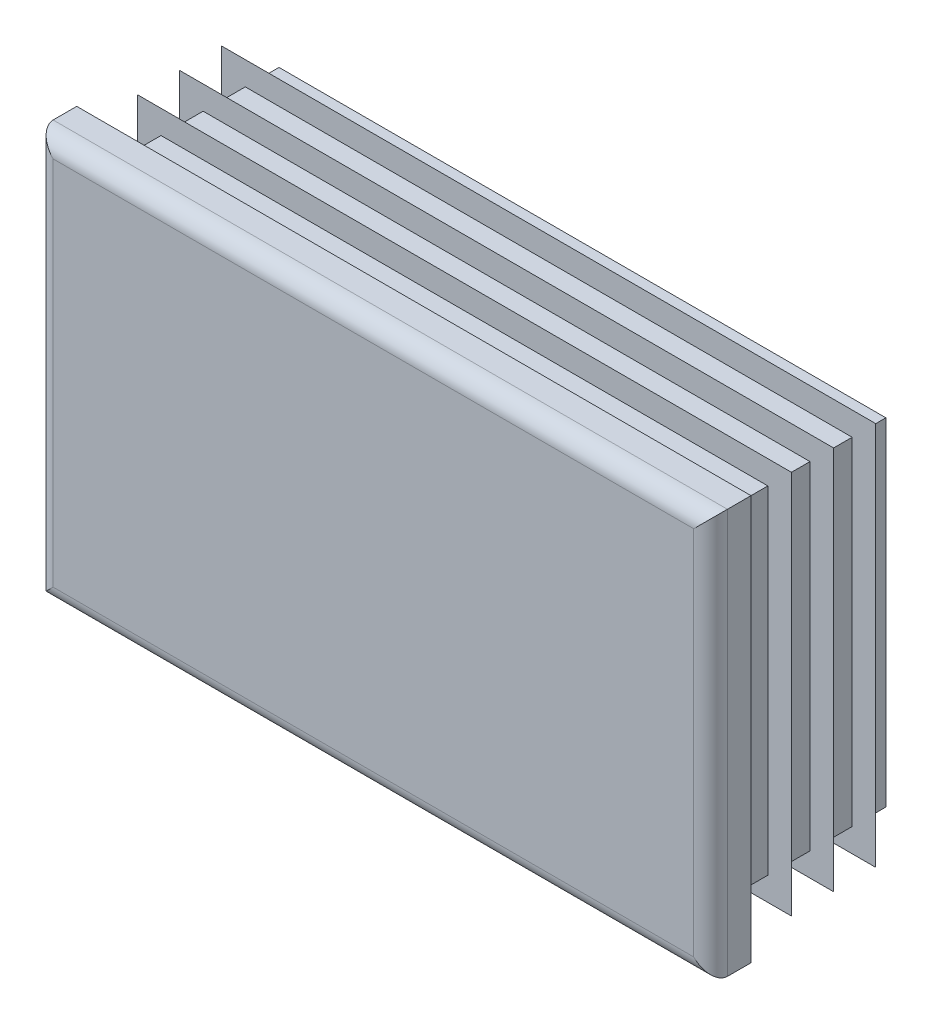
ISO-10303-21;
HEADER;
FILE_DESCRIPTION(('STEP AP214'),'2;1');
FILE_NAME('part.step','',(''),(''),'','','');
FILE_SCHEMA(('AUTOMOTIVE_DESIGN { 1 0 10303 214 1 1 1 1 }'));
ENDSEC;
DATA;
#1=APPLICATION_CONTEXT('core data for automotive mechanical design processes');
#2=APPLICATION_PROTOCOL_DEFINITION('international standard','automotive_design',2000,#1);
#3=PRODUCT_CONTEXT('',#1,'mechanical');
#4=PRODUCT('Part','Part','',(#3));
#5=PRODUCT_RELATED_PRODUCT_CATEGORY('part','',(#4));
#6=PRODUCT_DEFINITION_FORMATION('','',#4);
#7=PRODUCT_DEFINITION_CONTEXT('part definition',#1,'design');
#8=PRODUCT_DEFINITION('design','',#6,#7);
#9=PRODUCT_DEFINITION_SHAPE('','',#8);
#10=(LENGTH_UNIT() NAMED_UNIT(*) SI_UNIT(.MILLI.,.METRE.));
#11=(NAMED_UNIT(*) PLANE_ANGLE_UNIT() SI_UNIT($,.RADIAN.));
#12=(NAMED_UNIT(*) SI_UNIT($,.STERADIAN.) SOLID_ANGLE_UNIT());
#13=UNCERTAINTY_MEASURE_WITH_UNIT(LENGTH_MEASURE(1.E-05),#10,'distance_accuracy_value','');
#14=(GEOMETRIC_REPRESENTATION_CONTEXT(3) GLOBAL_UNCERTAINTY_ASSIGNED_CONTEXT((#13)) GLOBAL_UNIT_ASSIGNED_CONTEXT((#10,
#11,#12)) REPRESENTATION_CONTEXT('',''));
#15=CARTESIAN_POINT('',(0.,0.,0.));
#16=DIRECTION('',(0.,0.,1.));
#17=DIRECTION('',(1.,0.,0.));
#18=AXIS2_PLACEMENT_3D('',#15,#16,#17);
#19=CARTESIAN_POINT('',(47.5,-30.,6.));
#20=DIRECTION('',(0.,0.,-1.));
#21=DIRECTION('',(0.,1.,0.));
#22=AXIS2_PLACEMENT_3D('',#19,#20,#21);
#23=PLANE('',#22);
#24=DIRECTION('',(0.,1.,0.));
#25=VECTOR('',#24,1.);
#26=CARTESIAN_POINT('',(-47.5,-30.,6.));
#27=LINE('',#26,#25);
#28=CARTESIAN_POINT('',(-47.5,-27.5,6.));
#29=VERTEX_POINT('',#28);
#30=CARTESIAN_POINT('',(-47.5,27.5,6.));
#31=VERTEX_POINT('',#30);
#32=EDGE_CURVE('E310',#29,#31,#27,.T.);
#33=ORIENTED_EDGE('',*,*,#32,.F.);
#34=DIRECTION('',(-1.,0.,0.));
#35=VECTOR('',#34,1.);
#36=CARTESIAN_POINT('',(50.,-27.5,6.));
#37=LINE('',#36,#35);
#38=CARTESIAN_POINT('',(47.5,-27.5,6.));
#39=VERTEX_POINT('',#38);
#40=EDGE_CURVE('E482',#39,#29,#37,.T.);
#41=ORIENTED_EDGE('',*,*,#40,.F.);
#42=DIRECTION('',(0.,1.,0.));
#43=VECTOR('',#42,1.);
#44=CARTESIAN_POINT('',(47.5,-30.,6.));
#45=LINE('',#44,#43);
#46=CARTESIAN_POINT('',(47.5,27.5,6.));
#47=VERTEX_POINT('',#46);
#48=EDGE_CURVE('E305',#39,#47,#45,.T.);
#49=ORIENTED_EDGE('',*,*,#48,.T.);
#50=DIRECTION('',(-1.,0.,0.));
#51=VECTOR('',#50,1.);
#52=CARTESIAN_POINT('',(50.,27.5,6.));
#53=LINE('',#52,#51);
#54=EDGE_CURVE('E630',#47,#31,#53,.T.);
#55=ORIENTED_EDGE('',*,*,#54,.T.);
#56=EDGE_LOOP('',(#33,#41,#49,#55));
#57=FACE_BOUND('',#56,.T.);
#58=ADVANCED_FACE('F14',(#57),#23,.F.);
#59=CARTESIAN_POINT('',(-47.5,-30.,3.5));
#60=DIRECTION('',(0.,1.,0.));
#61=DIRECTION('',(-1.,0.,0.));
#62=AXIS2_PLACEMENT_3D('',#59,#60,#61);
#63=CYLINDRICAL_SURFACE('',#62,2.5);
#64=DIRECTION('',(0.,1.,0.));
#65=VECTOR('',#64,1.);
#66=CARTESIAN_POINT('',(-50.,-30.,3.5));
#67=LINE('',#66,#65);
#68=CARTESIAN_POINT('',(-50.,-30.,3.5));
#69=VERTEX_POINT('',#68);
#70=CARTESIAN_POINT('',(-50.,30.,3.5));
#71=VERTEX_POINT('',#70);
#72=EDGE_CURVE('E402',#69,#71,#67,.T.);
#73=ORIENTED_EDGE('',*,*,#72,.F.);
#74=CARTESIAN_POINT('',(-47.5,-27.5,3.5));
#75=DIRECTION('',(-0.707106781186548,0.707106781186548,0.));
#76=DIRECTION('',(0.707106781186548,0.707106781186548,0.));
#77=AXIS2_PLACEMENT_3D('',#74,#75,#76);
#78=ELLIPSE('',#77,3.53553390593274,2.5);
#79=EDGE_CURVE('E59',#69,#29,#78,.T.);
#80=ORIENTED_EDGE('',*,*,#79,.T.);
#81=ORIENTED_EDGE('',*,*,#32,.T.);
#82=CARTESIAN_POINT('',(-47.5,27.5,3.5));
#83=DIRECTION('',(0.707106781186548,0.707106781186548,0.));
#84=DIRECTION('',(-0.707106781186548,0.707106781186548,0.));
#85=AXIS2_PLACEMENT_3D('',#82,#83,#84);
#86=ELLIPSE('',#85,3.53553390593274,2.5);
#87=EDGE_CURVE('E306',#31,#71,#86,.F.);
#88=ORIENTED_EDGE('',*,*,#87,.T.);
#89=EDGE_LOOP('',(#73,#80,#81,#88));
#90=FACE_BOUND('',#89,.T.);
#91=ADVANCED_FACE('F16',(#90),#63,.T.);
#92=CARTESIAN_POINT('',(-50.,-30.,3.5));
#93=DIRECTION('',(1.,0.,0.));
#94=DIRECTION('',(0.,1.,0.));
#95=AXIS2_PLACEMENT_3D('',#92,#93,#94);
#96=PLANE('',#95);
#97=DIRECTION('',(0.,0.,-1.));
#98=VECTOR('',#97,1.);
#99=CARTESIAN_POINT('',(-50.,30.,3.5));
#100=LINE('',#99,#98);
#101=CARTESIAN_POINT('',(-50.,30.,0.));
#102=VERTEX_POINT('',#101);
#103=EDGE_CURVE('E615',#71,#102,#100,.T.);
#104=ORIENTED_EDGE('',*,*,#103,.T.);
#105=DIRECTION('',(0.,1.,0.));
#106=VECTOR('',#105,1.);
#107=CARTESIAN_POINT('',(-50.,-30.,0.));
#108=LINE('',#107,#106);
#109=CARTESIAN_POINT('',(-50.,-30.,0.));
#110=VERTEX_POINT('',#109);
#111=EDGE_CURVE('E400',#110,#102,#108,.T.);
#112=ORIENTED_EDGE('',*,*,#111,.F.);
#113=DIRECTION('',(0.,0.,-1.));
#114=VECTOR('',#113,1.);
#115=CARTESIAN_POINT('',(-50.,-30.,3.5));
#116=LINE('',#115,#114);
#117=EDGE_CURVE('E616',#69,#110,#116,.T.);
#118=ORIENTED_EDGE('',*,*,#117,.F.);
#119=ORIENTED_EDGE('',*,*,#72,.T.);
#120=EDGE_LOOP('',(#104,#112,#118,#119));
#121=FACE_BOUND('',#120,.T.);
#122=ADVANCED_FACE('F697',(#121),#96,.F.);
#123=CARTESIAN_POINT('',(-45.,-30.,0.));
#124=DIRECTION('',(1.,0.,0.));
#125=DIRECTION('',(0.,1.,0.));
#126=AXIS2_PLACEMENT_3D('',#123,#124,#125);
#127=PLANE('',#126);
#128=DIRECTION('',(0.,1.,0.));
#129=VECTOR('',#128,1.);
#130=CARTESIAN_POINT('',(-45.,-30.,0.));
#131=LINE('',#130,#129);
#132=CARTESIAN_POINT('',(-45.,-25.,0.));
#133=VERTEX_POINT('',#132);
#134=CARTESIAN_POINT('',(-45.,25.,0.));
#135=VERTEX_POINT('',#134);
#136=EDGE_CURVE('E397',#133,#135,#131,.T.);
#137=ORIENTED_EDGE('',*,*,#136,.T.);
#138=DIRECTION('',(0.,0.,-1.));
#139=VECTOR('',#138,1.);
#140=CARTESIAN_POINT('',(-45.,25.,0.));
#141=LINE('',#140,#139);
#142=CARTESIAN_POINT('',(-45.,25.,-1.25));
#143=VERTEX_POINT('',#142);
#144=EDGE_CURVE('E495',#135,#143,#141,.T.);
#145=ORIENTED_EDGE('',*,*,#144,.T.);
#146=DIRECTION('',(0.,1.,0.));
#147=VECTOR('',#146,1.);
#148=CARTESIAN_POINT('',(-45.,-30.,-1.25));
#149=LINE('',#148,#147);
#150=CARTESIAN_POINT('',(-45.,-25.,-1.25));
#151=VERTEX_POINT('',#150);
#152=EDGE_CURVE('E394',#151,#143,#149,.T.);
#153=ORIENTED_EDGE('',*,*,#152,.F.);
#154=DIRECTION('',(0.,0.,1.));
#155=VECTOR('',#154,1.);
#156=CARTESIAN_POINT('',(-45.,-25.,0.));
#157=LINE('',#156,#155);
#158=EDGE_CURVE('E489',#151,#133,#157,.T.);
#159=ORIENTED_EDGE('',*,*,#158,.T.);
#160=EDGE_LOOP('',(#137,#145,#153,#159));
#161=FACE_BOUND('',#160,.T.);
#162=ADVANCED_FACE('F787',(#161),#127,.F.);
#163=CARTESIAN_POINT('',(-48.5,-30.,-1.25));
#164=DIRECTION('',(0.342020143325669,0.,0.939692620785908));
#165=DIRECTION('',(-0.939692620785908,0.,0.342020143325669));
#166=AXIS2_PLACEMENT_3D('',#163,#164,#165);
#167=PLANE('',#166);
#168=DIRECTION('',(0.,1.,0.));
#169=VECTOR('',#168,1.);
#170=CARTESIAN_POINT('',(-48.5,-30.,-1.25));
#171=LINE('',#170,#169);
#172=CARTESIAN_POINT('',(-48.5,-28.5,-1.25));
#173=VERTEX_POINT('',#172);
#174=CARTESIAN_POINT('',(-48.5,28.5,-1.25));
#175=VERTEX_POINT('',#174);
#176=EDGE_CURVE('E392',#173,#175,#171,.T.);
#177=ORIENTED_EDGE('',*,*,#176,.T.);
#178=DIRECTION('',(0.844349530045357,-0.438895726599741,-0.307318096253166));
#179=VECTOR('',#178,1.);
#180=CARTESIAN_POINT('',(-26.8209880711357,17.2311766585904,-9.14051505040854));
#181=LINE('',#180,#179);
#182=CARTESIAN_POINT('',(-45.,26.6806882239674,-2.52389581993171));
#183=VERTEX_POINT('',#182);
#184=EDGE_CURVE('E519',#175,#183,#181,.T.);
#185=ORIENTED_EDGE('',*,*,#184,.T.);
#186=DIRECTION('',(0.,1.,0.));
#187=VECTOR('',#186,1.);
#188=CARTESIAN_POINT('',(-45.,-30.,-2.52389581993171));
#189=LINE('',#188,#187);
#190=CARTESIAN_POINT('',(-45.,-26.6806882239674,-2.52389581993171));
#191=VERTEX_POINT('',#190);
#192=EDGE_CURVE('E389',#191,#183,#189,.T.);
#193=ORIENTED_EDGE('',*,*,#192,.F.);
#194=DIRECTION('',(-0.844349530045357,-0.438895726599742,0.307318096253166));
#195=VECTOR('',#194,1.);
#196=CARTESIAN_POINT('',(-49.0558721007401,-28.7889441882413,-1.04767910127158));
#197=LINE('',#196,#195);
#198=EDGE_CURVE('E507',#191,#173,#197,.T.);
#199=ORIENTED_EDGE('',*,*,#198,.T.);
#200=EDGE_LOOP('',(#177,#185,#193,#199));
#201=FACE_BOUND('',#200,.T.);
#202=ADVANCED_FACE('F783',(#201),#167,.F.);
#203=CARTESIAN_POINT('',(-45.,-30.,-2.52389581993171));
#204=DIRECTION('',(1.,0.,0.));
#205=DIRECTION('',(0.,1.,0.));
#206=AXIS2_PLACEMENT_3D('',#203,#204,#205);
#207=PLANE('',#206);
#208=ORIENTED_EDGE('',*,*,#192,.T.);
#209=DIRECTION('',(0.,-0.819152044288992,-0.573576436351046));
#210=VECTOR('',#209,1.);
#211=CARTESIAN_POINT('',(-45.,-11.3526244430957,-29.1551080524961));
#212=LINE('',#211,#210);
#213=CARTESIAN_POINT('',(-45.,25.,-3.70072638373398));
#214=VERTEX_POINT('',#213);
#215=EDGE_CURVE('E516',#183,#214,#212,.T.);
#216=ORIENTED_EDGE('',*,*,#215,.T.);
#217=DIRECTION('',(0.,0.,-1.));
#218=VECTOR('',#217,1.);
#219=CARTESIAN_POINT('',(-45.,25.,-2.52389581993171));
#220=LINE('',#219,#218);
#221=CARTESIAN_POINT('',(-45.,25.,-7.5));
#222=VERTEX_POINT('',#221);
#223=EDGE_CURVE('E525',#214,#222,#220,.T.);
#224=ORIENTED_EDGE('',*,*,#223,.T.);
#225=DIRECTION('',(0.,1.,0.));
#226=VECTOR('',#225,1.);
#227=CARTESIAN_POINT('',(-45.,-30.,-7.5));
#228=LINE('',#227,#226);
#229=CARTESIAN_POINT('',(-45.,-25.,-7.5));
#230=VERTEX_POINT('',#229);
#231=EDGE_CURVE('E386',#230,#222,#228,.T.);
#232=ORIENTED_EDGE('',*,*,#231,.F.);
#233=DIRECTION('',(0.,0.,1.));
#234=VECTOR('',#233,1.);
#235=CARTESIAN_POINT('',(-45.,-25.,-2.52389581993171));
#236=LINE('',#235,#234);
#237=CARTESIAN_POINT('',(-45.,-25.,-3.70072638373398));
#238=VERTEX_POINT('',#237);
#239=EDGE_CURVE('E522',#230,#238,#236,.T.);
#240=ORIENTED_EDGE('',*,*,#239,.T.);
#241=DIRECTION('',(0.,-0.819152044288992,0.573576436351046));
#242=VECTOR('',#241,1.);
#243=CARTESIAN_POINT('',(-45.,-28.9079798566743,-0.964329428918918));
#244=LINE('',#243,#242);
#245=EDGE_CURVE('E504',#238,#191,#244,.T.);
#246=ORIENTED_EDGE('',*,*,#245,.T.);
#247=EDGE_LOOP('',(#208,#216,#224,#232,#240,#246));
#248=FACE_BOUND('',#247,.T.);
#249=ADVANCED_FACE('F779',(#248),#207,.F.);
#250=CARTESIAN_POINT('',(-48.5,-30.,-7.5));
#251=DIRECTION('',(0.342020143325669,0.,0.939692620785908));
#252=DIRECTION('',(-0.939692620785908,0.,0.342020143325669));
#253=AXIS2_PLACEMENT_3D('',#250,#251,#252);
#254=PLANE('',#253);
#255=DIRECTION('',(0.,1.,0.));
#256=VECTOR('',#255,1.);
#257=CARTESIAN_POINT('',(-48.5,-30.,-7.5));
#258=LINE('',#257,#256);
#259=CARTESIAN_POINT('',(-48.5,-28.5,-7.5));
#260=VERTEX_POINT('',#259);
#261=CARTESIAN_POINT('',(-48.5,28.5,-7.5));
#262=VERTEX_POINT('',#261);
#263=EDGE_CURVE('E384',#260,#262,#258,.T.);
#264=ORIENTED_EDGE('',*,*,#263,.T.);
#265=DIRECTION('',(0.844349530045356,-0.438895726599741,-0.307318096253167));
#266=VECTOR('',#265,1.);
#267=CARTESIAN_POINT('',(-26.8209880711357,17.2311766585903,-15.3905150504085));
#268=LINE('',#267,#266);
#269=CARTESIAN_POINT('',(-45.,26.6806882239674,-8.77389581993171));
#270=VERTEX_POINT('',#269);
#271=EDGE_CURVE('E549',#262,#270,#268,.T.);
#272=ORIENTED_EDGE('',*,*,#271,.T.);
#273=DIRECTION('',(0.,1.,0.));
#274=VECTOR('',#273,1.);
#275=CARTESIAN_POINT('',(-45.,-30.,-8.77389581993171));
#276=LINE('',#275,#274);
#277=CARTESIAN_POINT('',(-45.,-26.6806882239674,-8.77389581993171));
#278=VERTEX_POINT('',#277);
#279=EDGE_CURVE('E381',#278,#270,#276,.T.);
#280=ORIENTED_EDGE('',*,*,#279,.F.);
#281=DIRECTION('',(-0.844349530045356,-0.438895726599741,0.307318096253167));
#282=VECTOR('',#281,1.);
#283=CARTESIAN_POINT('',(-49.0558721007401,-28.7889441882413,-7.29767910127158));
#284=LINE('',#283,#282);
#285=EDGE_CURVE('E537',#278,#260,#284,.T.);
#286=ORIENTED_EDGE('',*,*,#285,.T.);
#287=EDGE_LOOP('',(#264,#272,#280,#286));
#288=FACE_BOUND('',#287,.T.);
#289=ADVANCED_FACE('F775',(#288),#254,.F.);
#290=CARTESIAN_POINT('',(-45.,-30.,-8.77389581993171));
#291=DIRECTION('',(1.,0.,0.));
#292=DIRECTION('',(0.,1.,0.));
#293=AXIS2_PLACEMENT_3D('',#290,#291,#292);
#294=PLANE('',#293);
#295=ORIENTED_EDGE('',*,*,#279,.T.);
#296=DIRECTION('',(0.,-0.819152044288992,-0.573576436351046));
#297=VECTOR('',#296,1.);
#298=CARTESIAN_POINT('',(-45.,-11.3526244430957,-35.4051080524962));
#299=LINE('',#298,#297);
#300=CARTESIAN_POINT('',(-45.,25.,-9.95072638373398));
#301=VERTEX_POINT('',#300);
#302=EDGE_CURVE('E546',#270,#301,#299,.T.);
#303=ORIENTED_EDGE('',*,*,#302,.T.);
#304=DIRECTION('',(0.,0.,-1.));
#305=VECTOR('',#304,1.);
#306=CARTESIAN_POINT('',(-45.,25.,-8.77389581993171));
#307=LINE('',#306,#305);
#308=CARTESIAN_POINT('',(-45.,25.,-13.75));
#309=VERTEX_POINT('',#308);
#310=EDGE_CURVE('E555',#301,#309,#307,.T.);
#311=ORIENTED_EDGE('',*,*,#310,.T.);
#312=DIRECTION('',(0.,1.,0.));
#313=VECTOR('',#312,1.);
#314=CARTESIAN_POINT('',(-45.,-30.,-13.75));
#315=LINE('',#314,#313);
#316=CARTESIAN_POINT('',(-45.,-25.,-13.75));
#317=VERTEX_POINT('',#316);
#318=EDGE_CURVE('E378',#317,#309,#315,.T.);
#319=ORIENTED_EDGE('',*,*,#318,.F.);
#320=DIRECTION('',(0.,0.,1.));
#321=VECTOR('',#320,1.);
#322=CARTESIAN_POINT('',(-45.,-25.,-8.77389581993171));
#323=LINE('',#322,#321);
#324=CARTESIAN_POINT('',(-45.,-25.,-9.95072638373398));
#325=VERTEX_POINT('',#324);
#326=EDGE_CURVE('E552',#317,#325,#323,.T.);
#327=ORIENTED_EDGE('',*,*,#326,.T.);
#328=DIRECTION('',(0.,-0.819152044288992,0.573576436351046));
#329=VECTOR('',#328,1.);
#330=CARTESIAN_POINT('',(-45.,-28.9079798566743,-7.21432942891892));
#331=LINE('',#330,#329);
#332=EDGE_CURVE('E534',#325,#278,#331,.T.);
#333=ORIENTED_EDGE('',*,*,#332,.T.);
#334=EDGE_LOOP('',(#295,#303,#311,#319,#327,#333));
#335=FACE_BOUND('',#334,.T.);
#336=ADVANCED_FACE('F771',(#335),#294,.F.);
#337=CARTESIAN_POINT('',(-48.5,-30.,-13.75));
#338=DIRECTION('',(0.342020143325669,0.,0.939692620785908));
#339=DIRECTION('',(-0.939692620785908,0.,0.342020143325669));
#340=AXIS2_PLACEMENT_3D('',#337,#338,#339);
#341=PLANE('',#340);
#342=DIRECTION('',(0.,1.,0.));
#343=VECTOR('',#342,1.);
#344=CARTESIAN_POINT('',(-48.5,-30.,-13.75));
#345=LINE('',#344,#343);
#346=CARTESIAN_POINT('',(-48.5,-28.5,-13.75));
#347=VERTEX_POINT('',#346);
#348=CARTESIAN_POINT('',(-48.5,28.5,-13.75));
#349=VERTEX_POINT('',#348);
#350=EDGE_CURVE('E376',#347,#349,#345,.T.);
#351=ORIENTED_EDGE('',*,*,#350,.T.);
#352=DIRECTION('',(0.844349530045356,-0.438895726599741,-0.307318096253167));
#353=VECTOR('',#352,1.);
#354=CARTESIAN_POINT('',(-26.8209880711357,17.2311766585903,-21.6405150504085));
#355=LINE('',#354,#353);
#356=CARTESIAN_POINT('',(-45.,26.6806882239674,-15.0238958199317));
#357=VERTEX_POINT('',#356);
#358=EDGE_CURVE('E579',#349,#357,#355,.T.);
#359=ORIENTED_EDGE('',*,*,#358,.T.);
#360=DIRECTION('',(0.,1.,0.));
#361=VECTOR('',#360,1.);
#362=CARTESIAN_POINT('',(-45.,-30.,-15.0238958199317));
#363=LINE('',#362,#361);
#364=CARTESIAN_POINT('',(-45.,-26.6806882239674,-15.0238958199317));
#365=VERTEX_POINT('',#364);
#366=EDGE_CURVE('E373',#365,#357,#363,.T.);
#367=ORIENTED_EDGE('',*,*,#366,.F.);
#368=DIRECTION('',(-0.844349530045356,-0.438895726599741,0.307318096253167));
#369=VECTOR('',#368,1.);
#370=CARTESIAN_POINT('',(-49.0558721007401,-28.7889441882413,-13.5476791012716));
#371=LINE('',#370,#369);
#372=EDGE_CURVE('E567',#365,#347,#371,.T.);
#373=ORIENTED_EDGE('',*,*,#372,.T.);
#374=EDGE_LOOP('',(#351,#359,#367,#373));
#375=FACE_BOUND('',#374,.T.);
#376=ADVANCED_FACE('F767',(#375),#341,.F.);
#377=CARTESIAN_POINT('',(-45.,-30.,-15.0238958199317));
#378=DIRECTION('',(1.,0.,0.));
#379=DIRECTION('',(0.,1.,0.));
#380=AXIS2_PLACEMENT_3D('',#377,#378,#379);
#381=PLANE('',#380);
#382=ORIENTED_EDGE('',*,*,#366,.T.);
#383=DIRECTION('',(0.,-0.819152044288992,-0.573576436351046));
#384=VECTOR('',#383,1.);
#385=CARTESIAN_POINT('',(-45.,-11.3526244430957,-41.6551080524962));
#386=LINE('',#385,#384);
#387=CARTESIAN_POINT('',(-45.,25.,-16.200726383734));
#388=VERTEX_POINT('',#387);
#389=EDGE_CURVE('E576',#357,#388,#386,.T.);
#390=ORIENTED_EDGE('',*,*,#389,.T.);
#391=DIRECTION('',(0.,0.,-1.));
#392=VECTOR('',#391,1.);
#393=CARTESIAN_POINT('',(-45.,25.,-15.0238958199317));
#394=LINE('',#393,#392);
#395=CARTESIAN_POINT('',(-45.,25.,-20.));
#396=VERTEX_POINT('',#395);
#397=EDGE_CURVE('E585',#388,#396,#394,.T.);
#398=ORIENTED_EDGE('',*,*,#397,.T.);
#399=DIRECTION('',(0.,1.,0.));
#400=VECTOR('',#399,1.);
#401=CARTESIAN_POINT('',(-45.,-30.,-20.));
#402=LINE('',#401,#400);
#403=CARTESIAN_POINT('',(-45.,-25.,-20.));
#404=VERTEX_POINT('',#403);
#405=EDGE_CURVE('E370',#404,#396,#402,.T.);
#406=ORIENTED_EDGE('',*,*,#405,.F.);
#407=DIRECTION('',(0.,0.,1.));
#408=VECTOR('',#407,1.);
#409=CARTESIAN_POINT('',(-45.,-25.,-15.0238958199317));
#410=LINE('',#409,#408);
#411=CARTESIAN_POINT('',(-45.,-25.,-16.200726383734));
#412=VERTEX_POINT('',#411);
#413=EDGE_CURVE('E582',#404,#412,#410,.T.);
#414=ORIENTED_EDGE('',*,*,#413,.T.);
#415=DIRECTION('',(0.,-0.819152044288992,0.573576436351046));
#416=VECTOR('',#415,1.);
#417=CARTESIAN_POINT('',(-45.,-28.9079798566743,-13.4643294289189));
#418=LINE('',#417,#416);
#419=EDGE_CURVE('E564',#412,#365,#418,.T.);
#420=ORIENTED_EDGE('',*,*,#419,.T.);
#421=EDGE_LOOP('',(#382,#390,#398,#406,#414,#420));
#422=FACE_BOUND('',#421,.T.);
#423=ADVANCED_FACE('F764',(#422),#381,.F.);
#424=CARTESIAN_POINT('',(-48.5,-30.,-20.));
#425=DIRECTION('',(0.342020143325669,0.,0.939692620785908));
#426=DIRECTION('',(-0.939692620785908,0.,0.342020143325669));
#427=AXIS2_PLACEMENT_3D('',#424,#425,#426);
#428=PLANE('',#427);
#429=DIRECTION('',(0.,1.,0.));
#430=VECTOR('',#429,1.);
#431=CARTESIAN_POINT('',(-48.5,-30.,-20.));
#432=LINE('',#431,#430);
#433=CARTESIAN_POINT('',(-48.5,-28.5,-20.));
#434=VERTEX_POINT('',#433);
#435=CARTESIAN_POINT('',(-48.5,28.5,-20.));
#436=VERTEX_POINT('',#435);
#437=EDGE_CURVE('E368',#434,#436,#432,.T.);
#438=ORIENTED_EDGE('',*,*,#437,.T.);
#439=DIRECTION('',(0.844349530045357,-0.438895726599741,-0.307318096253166));
#440=VECTOR('',#439,1.);
#441=CARTESIAN_POINT('',(-26.8209880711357,17.2311766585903,-27.8905150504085));
#442=LINE('',#441,#440);
#443=CARTESIAN_POINT('',(-45.,26.6806882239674,-21.2738958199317));
#444=VERTEX_POINT('',#443);
#445=EDGE_CURVE('E607',#436,#444,#442,.T.);
#446=ORIENTED_EDGE('',*,*,#445,.T.);
#447=DIRECTION('',(0.,1.,0.));
#448=VECTOR('',#447,1.);
#449=CARTESIAN_POINT('',(-45.,-30.,-21.2738958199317));
#450=LINE('',#449,#448);
#451=CARTESIAN_POINT('',(-45.,-26.6806882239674,-21.2738958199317));
#452=VERTEX_POINT('',#451);
#453=EDGE_CURVE('E365',#452,#444,#450,.T.);
#454=ORIENTED_EDGE('',*,*,#453,.F.);
#455=DIRECTION('',(-0.844349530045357,-0.438895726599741,0.307318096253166));
#456=VECTOR('',#455,1.);
#457=CARTESIAN_POINT('',(-49.0558721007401,-28.7889441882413,-19.7976791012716));
#458=LINE('',#457,#456);
#459=EDGE_CURVE('E595',#452,#434,#458,.T.);
#460=ORIENTED_EDGE('',*,*,#459,.T.);
#461=EDGE_LOOP('',(#438,#446,#454,#460));
#462=FACE_BOUND('',#461,.T.);
#463=ADVANCED_FACE('F675',(#462),#428,.F.);
#464=CARTESIAN_POINT('',(-45.,-30.,-21.2738958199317));
#465=DIRECTION('',(1.,0.,0.));
#466=DIRECTION('',(0.,1.,0.));
#467=AXIS2_PLACEMENT_3D('',#464,#465,#466);
#468=PLANE('',#467);
#469=ORIENTED_EDGE('',*,*,#453,.T.);
#470=DIRECTION('',(0.,-0.819152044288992,-0.573576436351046));
#471=VECTOR('',#470,1.);
#472=CARTESIAN_POINT('',(-45.,-11.3526244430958,-47.9051080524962));
#473=LINE('',#472,#471);
#474=CARTESIAN_POINT('',(-45.,25.,-22.450726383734));
#475=VERTEX_POINT('',#474);
#476=EDGE_CURVE('E604',#444,#475,#473,.T.);
#477=ORIENTED_EDGE('',*,*,#476,.T.);
#478=DIRECTION('',(0.,0.,-1.));
#479=VECTOR('',#478,1.);
#480=CARTESIAN_POINT('',(-45.,25.,-21.2738958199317));
#481=LINE('',#480,#479);
#482=CARTESIAN_POINT('',(-45.,25.,-25.));
#483=VERTEX_POINT('',#482);
#484=EDGE_CURVE('E613',#475,#483,#481,.T.);
#485=ORIENTED_EDGE('',*,*,#484,.T.);
#486=DIRECTION('',(0.,1.,0.));
#487=VECTOR('',#486,1.);
#488=CARTESIAN_POINT('',(-45.,-30.,-25.));
#489=LINE('',#488,#487);
#490=CARTESIAN_POINT('',(-45.,-25.,-25.));
#491=VERTEX_POINT('',#490);
#492=EDGE_CURVE('E362',#491,#483,#489,.T.);
#493=ORIENTED_EDGE('',*,*,#492,.F.);
#494=DIRECTION('',(0.,0.,1.));
#495=VECTOR('',#494,1.);
#496=CARTESIAN_POINT('',(-45.,-25.,-21.2738958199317));
#497=LINE('',#496,#495);
#498=CARTESIAN_POINT('',(-45.,-25.,-22.450726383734));
#499=VERTEX_POINT('',#498);
#500=EDGE_CURVE('E610',#491,#499,#497,.T.);
#501=ORIENTED_EDGE('',*,*,#500,.T.);
#502=DIRECTION('',(0.,-0.819152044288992,0.573576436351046));
#503=VECTOR('',#502,1.);
#504=CARTESIAN_POINT('',(-45.,-28.9079798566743,-19.7143294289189));
#505=LINE('',#504,#503);
#506=EDGE_CURVE('E592',#499,#452,#505,.T.);
#507=ORIENTED_EDGE('',*,*,#506,.T.);
#508=EDGE_LOOP('',(#469,#477,#485,#493,#501,#507));
#509=FACE_BOUND('',#508,.T.);
#510=ADVANCED_FACE('F677',(#509),#468,.F.);
#511=CARTESIAN_POINT('',(-45.,-30.,-25.));
#512=DIRECTION('',(0.,0.,1.));
#513=DIRECTION('',(0.,-1.,0.));
#514=AXIS2_PLACEMENT_3D('',#511,#512,#513);
#515=PLANE('',#514);
#516=ORIENTED_EDGE('',*,*,#492,.T.);
#517=DIRECTION('',(-1.,0.,0.));
#518=VECTOR('',#517,1.);
#519=CARTESIAN_POINT('',(50.,25.,-25.));
#520=LINE('',#519,#518);
#521=CARTESIAN_POINT('',(45.,25.,-25.));
#522=VERTEX_POINT('',#521);
#523=EDGE_CURVE('E438',#522,#483,#520,.T.);
#524=ORIENTED_EDGE('',*,*,#523,.F.);
#525=DIRECTION('',(0.,1.,0.));
#526=VECTOR('',#525,1.);
#527=CARTESIAN_POINT('',(45.,-30.,-25.));
#528=LINE('',#527,#526);
#529=CARTESIAN_POINT('',(45.,-25.,-25.));
#530=VERTEX_POINT('',#529);
#531=EDGE_CURVE('E359',#530,#522,#528,.T.);
#532=ORIENTED_EDGE('',*,*,#531,.F.);
#533=DIRECTION('',(-1.,0.,0.));
#534=VECTOR('',#533,1.);
#535=CARTESIAN_POINT('',(50.,-25.,-25.));
#536=LINE('',#535,#534);
#537=EDGE_CURVE('E436',#530,#491,#536,.T.);
#538=ORIENTED_EDGE('',*,*,#537,.T.);
#539=EDGE_LOOP('',(#516,#524,#532,#538));
#540=FACE_BOUND('',#539,.T.);
#541=ADVANCED_FACE('F435',(#540),#515,.F.);
#542=CARTESIAN_POINT('',(45.,-30.,-25.));
#543=DIRECTION('',(-1.,0.,0.));
#544=DIRECTION('',(0.,-1.,0.));
#545=AXIS2_PLACEMENT_3D('',#542,#543,#544);
#546=PLANE('',#545);
#547=DIRECTION('',(0.,0.,1.));
#548=VECTOR('',#547,1.);
#549=CARTESIAN_POINT('',(45.,25.,-25.));
#550=LINE('',#549,#548);
#551=CARTESIAN_POINT('',(45.,25.,-22.450726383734));
#552=VERTEX_POINT('',#551);
#553=EDGE_CURVE('E9',#522,#552,#550,.T.);
#554=ORIENTED_EDGE('',*,*,#553,.T.);
#555=DIRECTION('',(0.,0.819152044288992,0.573576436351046));
#556=VECTOR('',#555,1.);
#557=CARTESIAN_POINT('',(45.,-13.1033207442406,-49.1309587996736));
#558=LINE('',#557,#556);
#559=CARTESIAN_POINT('',(45.,26.6806882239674,-21.2738958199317));
#560=VERTEX_POINT('',#559);
#561=EDGE_CURVE('E601',#552,#560,#558,.T.);
#562=ORIENTED_EDGE('',*,*,#561,.T.);
#563=DIRECTION('',(0.,1.,0.));
#564=VECTOR('',#563,1.);
#565=CARTESIAN_POINT('',(45.,-30.,-21.2738958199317));
#566=LINE('',#565,#564);
#567=CARTESIAN_POINT('',(45.,-26.6806882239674,-21.2738958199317));
#568=VERTEX_POINT('',#567);
#569=EDGE_CURVE('E356',#568,#560,#566,.T.);
#570=ORIENTED_EDGE('',*,*,#569,.F.);
#571=DIRECTION('',(0.,0.819152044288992,-0.573576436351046));
#572=VECTOR('',#571,1.);
#573=CARTESIAN_POINT('',(45.,-27.1572835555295,-20.9401801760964));
#574=LINE('',#573,#572);
#575=CARTESIAN_POINT('',(45.,-25.,-22.450726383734));
#576=VERTEX_POINT('',#575);
#577=EDGE_CURVE('E428',#568,#576,#574,.T.);
#578=ORIENTED_EDGE('',*,*,#577,.T.);
#579=DIRECTION('',(0.,0.,-1.));
#580=VECTOR('',#579,1.);
#581=CARTESIAN_POINT('',(45.,-25.,-25.));
#582=LINE('',#581,#580);
#583=EDGE_CURVE('E23',#576,#530,#582,.T.);
#584=ORIENTED_EDGE('',*,*,#583,.T.);
#585=ORIENTED_EDGE('',*,*,#531,.T.);
#586=EDGE_LOOP('',(#554,#562,#570,#578,#584,#585));
#587=FACE_BOUND('',#586,.T.);
#588=ADVANCED_FACE('F426',(#587),#546,.F.);
#589=CARTESIAN_POINT('',(45.,-30.,-21.2738958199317));
#590=DIRECTION('',(-0.342020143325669,0.,0.939692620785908));
#591=DIRECTION('',(-0.939692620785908,0.,-0.342020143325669));
#592=AXIS2_PLACEMENT_3D('',#589,#590,#591);
#593=PLANE('',#592);
#594=ORIENTED_EDGE('',*,*,#569,.T.);
#595=DIRECTION('',(0.844349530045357,0.438895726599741,0.307318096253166));
#596=VECTOR('',#595,1.);
#597=CARTESIAN_POINT('',(23.995191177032,15.7623179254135,-28.9190210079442));
#598=LINE('',#597,#596);
#599=CARTESIAN_POINT('',(48.5,28.5,-20.));
#600=VERTEX_POINT('',#599);
#601=EDGE_CURVE('E598',#560,#600,#598,.T.);
#602=ORIENTED_EDGE('',*,*,#601,.T.);
#603=DIRECTION('',(0.,1.,0.));
#604=VECTOR('',#603,1.);
#605=CARTESIAN_POINT('',(48.5,-30.,-20.));
#606=LINE('',#605,#604);
#607=CARTESIAN_POINT('',(48.5,-28.5,-20.));
#608=VERTEX_POINT('',#607);
#609=EDGE_CURVE('E353',#608,#600,#606,.T.);
#610=ORIENTED_EDGE('',*,*,#609,.F.);
#611=DIRECTION('',(-0.844349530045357,0.438895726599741,-0.307318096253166));
#612=VECTOR('',#611,1.);
#613=CARTESIAN_POINT('',(46.2300752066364,-27.3200854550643,-20.8261850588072));
#614=LINE('',#613,#612);
#615=EDGE_CURVE('E588',#608,#568,#614,.T.);
#616=ORIENTED_EDGE('',*,*,#615,.T.);
#617=EDGE_LOOP('',(#594,#602,#610,#616));
#618=FACE_BOUND('',#617,.T.);
#619=ADVANCED_FACE('F752',(#618),#593,.F.);
#620=CARTESIAN_POINT('',(48.5,-30.,-20.));
#621=DIRECTION('',(0.,0.,-1.));
#622=DIRECTION('',(0.,1.,0.));
#623=AXIS2_PLACEMENT_3D('',#620,#621,#622);
#624=PLANE('',#623);
#625=ORIENTED_EDGE('',*,*,#609,.T.);
#626=DIRECTION('',(-1.,0.,0.));
#627=VECTOR('',#626,1.);
#628=CARTESIAN_POINT('',(50.,28.5,-20.));
#629=LINE('',#628,#627);
#630=EDGE_CURVE('E444',#600,#436,#629,.T.);
#631=ORIENTED_EDGE('',*,*,#630,.T.);
#632=ORIENTED_EDGE('',*,*,#437,.F.);
#633=DIRECTION('',(-1.,0.,0.));
#634=VECTOR('',#633,1.);
#635=CARTESIAN_POINT('',(50.,-28.5,-20.));
#636=LINE('',#635,#634);
#637=EDGE_CURVE('E451',#608,#434,#636,.T.);
#638=ORIENTED_EDGE('',*,*,#637,.F.);
#639=EDGE_LOOP('',(#625,#631,#632,#638));
#640=FACE_BOUND('',#639,.T.);
#641=ORIENTED_EDGE('',*,*,#405,.T.);
#642=DIRECTION('',(-1.,0.,0.));
#643=VECTOR('',#642,1.);
#644=CARTESIAN_POINT('',(50.,25.,-20.));
#645=LINE('',#644,#643);
#646=CARTESIAN_POINT('',(45.,25.,-20.));
#647=VERTEX_POINT('',#646);
#648=EDGE_CURVE('E663',#647,#396,#645,.T.);
#649=ORIENTED_EDGE('',*,*,#648,.F.);
#650=DIRECTION('',(0.,1.,0.));
#651=VECTOR('',#650,1.);
#652=CARTESIAN_POINT('',(45.,-30.,-20.));
#653=LINE('',#652,#651);
#654=CARTESIAN_POINT('',(45.,-25.,-20.));
#655=VERTEX_POINT('',#654);
#656=EDGE_CURVE('E350',#655,#647,#653,.T.);
#657=ORIENTED_EDGE('',*,*,#656,.F.);
#658=DIRECTION('',(-1.,0.,0.));
#659=VECTOR('',#658,1.);
#660=CARTESIAN_POINT('',(50.,-25.,-20.));
#661=LINE('',#660,#659);
#662=EDGE_CURVE('E453',#655,#404,#661,.T.);
#663=ORIENTED_EDGE('',*,*,#662,.T.);
#664=EDGE_LOOP('',(#641,#649,#657,#663));
#665=FACE_BOUND('',#664,.T.);
#666=ADVANCED_FACE('F667',(#640,#665),#624,.F.);
#667=CARTESIAN_POINT('',(45.,-30.,-20.));
#668=DIRECTION('',(-1.,0.,0.));
#669=DIRECTION('',(0.,-1.,0.));
#670=AXIS2_PLACEMENT_3D('',#667,#668,#669);
#671=PLANE('',#670);
#672=DIRECTION('',(0.,0.,1.));
#673=VECTOR('',#672,1.);
#674=CARTESIAN_POINT('',(45.,25.,-20.));
#675=LINE('',#674,#673);
#676=CARTESIAN_POINT('',(45.,25.,-16.200726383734));
#677=VERTEX_POINT('',#676);
#678=EDGE_CURVE('E420',#647,#677,#675,.T.);
#679=ORIENTED_EDGE('',*,*,#678,.T.);
#680=DIRECTION('',(0.,0.819152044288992,0.573576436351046));
#681=VECTOR('',#680,1.);
#682=CARTESIAN_POINT('',(45.,-13.6906286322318,-43.2921962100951));
#683=LINE('',#682,#681);
#684=CARTESIAN_POINT('',(45.,26.6806882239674,-15.0238958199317));
#685=VERTEX_POINT('',#684);
#686=EDGE_CURVE('E573',#677,#685,#683,.T.);
#687=ORIENTED_EDGE('',*,*,#686,.T.);
#688=DIRECTION('',(0.,1.,0.));
#689=VECTOR('',#688,1.);
#690=CARTESIAN_POINT('',(45.,-30.,-15.0238958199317));
#691=LINE('',#690,#689);
#692=CARTESIAN_POINT('',(45.,-26.6806882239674,-15.0238958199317));
#693=VERTEX_POINT('',#692);
#694=EDGE_CURVE('E347',#693,#685,#691,.T.);
#695=ORIENTED_EDGE('',*,*,#694,.F.);
#696=DIRECTION('',(0.,0.819152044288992,-0.573576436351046));
#697=VECTOR('',#696,1.);
#698=CARTESIAN_POINT('',(45.,-26.5699756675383,-15.1014175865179));
#699=LINE('',#698,#697);
#700=CARTESIAN_POINT('',(45.,-25.,-16.200726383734));
#701=VERTEX_POINT('',#700);
#702=EDGE_CURVE('E561',#693,#701,#699,.T.);
#703=ORIENTED_EDGE('',*,*,#702,.T.);
#704=DIRECTION('',(0.,0.,-1.));
#705=VECTOR('',#704,1.);
#706=CARTESIAN_POINT('',(45.,-25.,-20.));
#707=LINE('',#706,#705);
#708=EDGE_CURVE('E417',#701,#655,#707,.T.);
#709=ORIENTED_EDGE('',*,*,#708,.T.);
#710=ORIENTED_EDGE('',*,*,#656,.T.);
#711=EDGE_LOOP('',(#679,#687,#695,#703,#709,#710));
#712=FACE_BOUND('',#711,.T.);
#713=ADVANCED_FACE('F745',(#712),#671,.F.);
#714=CARTESIAN_POINT('',(45.,-30.,-15.0238958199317));
#715=DIRECTION('',(-0.342020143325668,0.,0.939692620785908));
#716=DIRECTION('',(-0.939692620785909,0.,-0.342020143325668));
#717=AXIS2_PLACEMENT_3D('',#714,#715,#716);
#718=PLANE('',#717);
#719=ORIENTED_EDGE('',*,*,#694,.T.);
#720=DIRECTION('',(0.844349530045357,0.43889572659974,0.307318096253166));
#721=VECTOR('',#720,1.);
#722=CARTESIAN_POINT('',(23.995191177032,15.7623179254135,-22.6690210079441));
#723=LINE('',#722,#721);
#724=CARTESIAN_POINT('',(48.5,28.5,-13.75));
#725=VERTEX_POINT('',#724);
#726=EDGE_CURVE('E570',#685,#725,#723,.T.);
#727=ORIENTED_EDGE('',*,*,#726,.T.);
#728=DIRECTION('',(0.,1.,0.));
#729=VECTOR('',#728,1.);
#730=CARTESIAN_POINT('',(48.5,-30.,-13.75));
#731=LINE('',#730,#729);
#732=CARTESIAN_POINT('',(48.5,-28.5,-13.75));
#733=VERTEX_POINT('',#732);
#734=EDGE_CURVE('E344',#733,#725,#731,.T.);
#735=ORIENTED_EDGE('',*,*,#734,.F.);
#736=DIRECTION('',(-0.844349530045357,0.43889572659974,-0.307318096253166));
#737=VECTOR('',#736,1.);
#738=CARTESIAN_POINT('',(46.2300752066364,-27.3200854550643,-14.5761850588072));
#739=LINE('',#738,#737);
#740=EDGE_CURVE('E558',#733,#693,#739,.T.);
#741=ORIENTED_EDGE('',*,*,#740,.T.);
#742=EDGE_LOOP('',(#719,#727,#735,#741));
#743=FACE_BOUND('',#742,.T.);
#744=ADVANCED_FACE('F741',(#743),#718,.F.);
#745=CARTESIAN_POINT('',(48.5,-30.,-13.75));
#746=DIRECTION('',(0.,0.,-1.));
#747=DIRECTION('',(0.,1.,0.));
#748=AXIS2_PLACEMENT_3D('',#745,#746,#747);
#749=PLANE('',#748);
#750=ORIENTED_EDGE('',*,*,#734,.T.);
#751=DIRECTION('',(-1.,0.,0.));
#752=VECTOR('',#751,1.);
#753=CARTESIAN_POINT('',(50.,28.5,-13.75));
#754=LINE('',#753,#752);
#755=EDGE_CURVE('E657',#725,#349,#754,.T.);
#756=ORIENTED_EDGE('',*,*,#755,.T.);
#757=ORIENTED_EDGE('',*,*,#350,.F.);
#758=DIRECTION('',(-1.,0.,0.));
#759=VECTOR('',#758,1.);
#760=CARTESIAN_POINT('',(50.,-28.5,-13.75));
#761=LINE('',#760,#759);
#762=EDGE_CURVE('E459',#733,#347,#761,.T.);
#763=ORIENTED_EDGE('',*,*,#762,.F.);
#764=EDGE_LOOP('',(#750,#756,#757,#763));
#765=FACE_BOUND('',#764,.T.);
#766=ORIENTED_EDGE('',*,*,#318,.T.);
#767=DIRECTION('',(-1.,0.,0.));
#768=VECTOR('',#767,1.);
#769=CARTESIAN_POINT('',(50.,25.,-13.75));
#770=LINE('',#769,#768);
#771=CARTESIAN_POINT('',(45.,25.,-13.75));
#772=VERTEX_POINT('',#771);
#773=EDGE_CURVE('E655',#772,#309,#770,.T.);
#774=ORIENTED_EDGE('',*,*,#773,.F.);
#775=DIRECTION('',(0.,1.,0.));
#776=VECTOR('',#775,1.);
#777=CARTESIAN_POINT('',(45.,-30.,-13.75));
#778=LINE('',#777,#776);
#779=CARTESIAN_POINT('',(45.,-25.,-13.75));
#780=VERTEX_POINT('',#779);
#781=EDGE_CURVE('E341',#780,#772,#778,.T.);
#782=ORIENTED_EDGE('',*,*,#781,.F.);
#783=DIRECTION('',(-1.,0.,0.));
#784=VECTOR('',#783,1.);
#785=CARTESIAN_POINT('',(50.,-25.,-13.75));
#786=LINE('',#785,#784);
#787=EDGE_CURVE('E461',#780,#317,#786,.T.);
#788=ORIENTED_EDGE('',*,*,#787,.T.);
#789=EDGE_LOOP('',(#766,#774,#782,#788));
#790=FACE_BOUND('',#789,.T.);
#791=ADVANCED_FACE('F737',(#765,#790),#749,.F.);
#792=CARTESIAN_POINT('',(45.,-30.,-13.75));
#793=DIRECTION('',(-1.,0.,0.));
#794=DIRECTION('',(0.,-1.,0.));
#795=AXIS2_PLACEMENT_3D('',#792,#793,#794);
#796=PLANE('',#795);
#797=DIRECTION('',(0.,0.,1.));
#798=VECTOR('',#797,1.);
#799=CARTESIAN_POINT('',(45.,25.,-13.75));
#800=LINE('',#799,#798);
#801=CARTESIAN_POINT('',(45.,25.,-9.95072638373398));
#802=VERTEX_POINT('',#801);
#803=EDGE_CURVE('E414',#772,#802,#800,.T.);
#804=ORIENTED_EDGE('',*,*,#803,.T.);
#805=DIRECTION('',(0.,0.819152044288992,0.573576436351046));
#806=VECTOR('',#805,1.);
#807=CARTESIAN_POINT('',(45.,-13.6906286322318,-37.0421962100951));
#808=LINE('',#807,#806);
#809=CARTESIAN_POINT('',(45.,26.6806882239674,-8.77389581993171));
#810=VERTEX_POINT('',#809);
#811=EDGE_CURVE('E543',#802,#810,#808,.T.);
#812=ORIENTED_EDGE('',*,*,#811,.T.);
#813=DIRECTION('',(0.,1.,0.));
#814=VECTOR('',#813,1.);
#815=CARTESIAN_POINT('',(45.,-30.,-8.77389581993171));
#816=LINE('',#815,#814);
#817=CARTESIAN_POINT('',(45.,-26.6806882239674,-8.77389581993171));
#818=VERTEX_POINT('',#817);
#819=EDGE_CURVE('E338',#818,#810,#816,.T.);
#820=ORIENTED_EDGE('',*,*,#819,.F.);
#821=DIRECTION('',(0.,0.819152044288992,-0.573576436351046));
#822=VECTOR('',#821,1.);
#823=CARTESIAN_POINT('',(45.,-26.5699756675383,-8.85141758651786));
#824=LINE('',#823,#822);
#825=CARTESIAN_POINT('',(45.,-25.,-9.95072638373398));
#826=VERTEX_POINT('',#825);
#827=EDGE_CURVE('E531',#818,#826,#824,.T.);
#828=ORIENTED_EDGE('',*,*,#827,.T.);
#829=DIRECTION('',(0.,0.,-1.));
#830=VECTOR('',#829,1.);
#831=CARTESIAN_POINT('',(45.,-25.,-13.75));
#832=LINE('',#831,#830);
#833=EDGE_CURVE('E411',#826,#780,#832,.T.);
#834=ORIENTED_EDGE('',*,*,#833,.T.);
#835=ORIENTED_EDGE('',*,*,#781,.T.);
#836=EDGE_LOOP('',(#804,#812,#820,#828,#834,#835));
#837=FACE_BOUND('',#836,.T.);
#838=ADVANCED_FACE('F733',(#837),#796,.F.);
#839=CARTESIAN_POINT('',(45.,-30.,-8.77389581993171));
#840=DIRECTION('',(-0.342020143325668,0.,0.939692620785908));
#841=DIRECTION('',(-0.939692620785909,0.,-0.342020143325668));
#842=AXIS2_PLACEMENT_3D('',#839,#840,#841);
#843=PLANE('',#842);
#844=ORIENTED_EDGE('',*,*,#819,.T.);
#845=DIRECTION('',(0.844349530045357,0.43889572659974,0.307318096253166));
#846=VECTOR('',#845,1.);
#847=CARTESIAN_POINT('',(23.995191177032,15.7623179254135,-16.4190210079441));
#848=LINE('',#847,#846);
#849=CARTESIAN_POINT('',(48.5,28.5,-7.5));
#850=VERTEX_POINT('',#849);
#851=EDGE_CURVE('E540',#810,#850,#848,.T.);
#852=ORIENTED_EDGE('',*,*,#851,.T.);
#853=DIRECTION('',(0.,1.,0.));
#854=VECTOR('',#853,1.);
#855=CARTESIAN_POINT('',(48.5,-30.,-7.5));
#856=LINE('',#855,#854);
#857=CARTESIAN_POINT('',(48.5,-28.5,-7.5));
#858=VERTEX_POINT('',#857);
#859=EDGE_CURVE('E335',#858,#850,#856,.T.);
#860=ORIENTED_EDGE('',*,*,#859,.F.);
#861=DIRECTION('',(-0.844349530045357,0.43889572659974,-0.307318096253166));
#862=VECTOR('',#861,1.);
#863=CARTESIAN_POINT('',(46.2300752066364,-27.3200854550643,-8.32618505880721));
#864=LINE('',#863,#862);
#865=EDGE_CURVE('E528',#858,#818,#864,.T.);
#866=ORIENTED_EDGE('',*,*,#865,.T.);
#867=EDGE_LOOP('',(#844,#852,#860,#866));
#868=FACE_BOUND('',#867,.T.);
#869=ADVANCED_FACE('F729',(#868),#843,.F.);
#870=CARTESIAN_POINT('',(48.5,-30.,-7.5));
#871=DIRECTION('',(0.,0.,-1.));
#872=DIRECTION('',(0.,1.,0.));
#873=AXIS2_PLACEMENT_3D('',#870,#871,#872);
#874=PLANE('',#873);
#875=ORIENTED_EDGE('',*,*,#859,.T.);
#876=DIRECTION('',(-1.,0.,0.));
#877=VECTOR('',#876,1.);
#878=CARTESIAN_POINT('',(50.,28.5,-7.5));
#879=LINE('',#878,#877);
#880=EDGE_CURVE('E649',#850,#262,#879,.T.);
#881=ORIENTED_EDGE('',*,*,#880,.T.);
#882=ORIENTED_EDGE('',*,*,#263,.F.);
#883=DIRECTION('',(-1.,0.,0.));
#884=VECTOR('',#883,1.);
#885=CARTESIAN_POINT('',(50.,-28.5,-7.5));
#886=LINE('',#885,#884);
#887=EDGE_CURVE('E467',#858,#260,#886,.T.);
#888=ORIENTED_EDGE('',*,*,#887,.F.);
#889=EDGE_LOOP('',(#875,#881,#882,#888));
#890=FACE_BOUND('',#889,.T.);
#891=ORIENTED_EDGE('',*,*,#231,.T.);
#892=DIRECTION('',(-1.,0.,0.));
#893=VECTOR('',#892,1.);
#894=CARTESIAN_POINT('',(50.,25.,-7.5));
#895=LINE('',#894,#893);
#896=CARTESIAN_POINT('',(45.,25.,-7.5));
#897=VERTEX_POINT('',#896);
#898=EDGE_CURVE('E647',#897,#222,#895,.T.);
#899=ORIENTED_EDGE('',*,*,#898,.F.);
#900=DIRECTION('',(0.,1.,0.));
#901=VECTOR('',#900,1.);
#902=CARTESIAN_POINT('',(45.,-30.,-7.5));
#903=LINE('',#902,#901);
#904=CARTESIAN_POINT('',(45.,-25.,-7.5));
#905=VERTEX_POINT('',#904);
#906=EDGE_CURVE('E332',#905,#897,#903,.T.);
#907=ORIENTED_EDGE('',*,*,#906,.F.);
#908=DIRECTION('',(-1.,0.,0.));
#909=VECTOR('',#908,1.);
#910=CARTESIAN_POINT('',(50.,-25.,-7.5));
#911=LINE('',#910,#909);
#912=EDGE_CURVE('E469',#905,#230,#911,.T.);
#913=ORIENTED_EDGE('',*,*,#912,.T.);
#914=EDGE_LOOP('',(#891,#899,#907,#913));
#915=FACE_BOUND('',#914,.T.);
#916=ADVANCED_FACE('F725',(#890,#915),#874,.F.);
#917=CARTESIAN_POINT('',(45.,-30.,-7.5));
#918=DIRECTION('',(-1.,0.,0.));
#919=DIRECTION('',(0.,-1.,0.));
#920=AXIS2_PLACEMENT_3D('',#917,#918,#919);
#921=PLANE('',#920);
#922=DIRECTION('',(0.,0.,1.));
#923=VECTOR('',#922,1.);
#924=CARTESIAN_POINT('',(45.,25.,-7.5));
#925=LINE('',#924,#923);
#926=CARTESIAN_POINT('',(45.,25.,-3.70072638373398));
#927=VERTEX_POINT('',#926);
#928=EDGE_CURVE('E408',#897,#927,#925,.T.);
#929=ORIENTED_EDGE('',*,*,#928,.T.);
#930=DIRECTION('',(0.,0.819152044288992,0.573576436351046));
#931=VECTOR('',#930,1.);
#932=CARTESIAN_POINT('',(45.,-13.6906286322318,-30.7921962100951));
#933=LINE('',#932,#931);
#934=CARTESIAN_POINT('',(45.,26.6806882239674,-2.52389581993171));
#935=VERTEX_POINT('',#934);
#936=EDGE_CURVE('E513',#927,#935,#933,.T.);
#937=ORIENTED_EDGE('',*,*,#936,.T.);
#938=DIRECTION('',(0.,1.,0.));
#939=VECTOR('',#938,1.);
#940=CARTESIAN_POINT('',(45.,-30.,-2.52389581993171));
#941=LINE('',#940,#939);
#942=CARTESIAN_POINT('',(45.,-26.6806882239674,-2.52389581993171));
#943=VERTEX_POINT('',#942);
#944=EDGE_CURVE('E329',#943,#935,#941,.T.);
#945=ORIENTED_EDGE('',*,*,#944,.F.);
#946=DIRECTION('',(0.,0.819152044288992,-0.573576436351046));
#947=VECTOR('',#946,1.);
#948=CARTESIAN_POINT('',(45.,-26.5699756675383,-2.60141758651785));
#949=LINE('',#948,#947);
#950=CARTESIAN_POINT('',(45.,-25.,-3.70072638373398));
#951=VERTEX_POINT('',#950);
#952=EDGE_CURVE('E501',#943,#951,#949,.T.);
#953=ORIENTED_EDGE('',*,*,#952,.T.);
#954=DIRECTION('',(0.,0.,-1.));
#955=VECTOR('',#954,1.);
#956=CARTESIAN_POINT('',(45.,-25.,-7.5));
#957=LINE('',#956,#955);
#958=EDGE_CURVE('E405',#951,#905,#957,.T.);
#959=ORIENTED_EDGE('',*,*,#958,.T.);
#960=ORIENTED_EDGE('',*,*,#906,.T.);
#961=EDGE_LOOP('',(#929,#937,#945,#953,#959,#960));
#962=FACE_BOUND('',#961,.T.);
#963=ADVANCED_FACE('F721',(#962),#921,.F.);
#964=CARTESIAN_POINT('',(45.,-30.,-2.52389581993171));
#965=DIRECTION('',(-0.342020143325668,0.,0.939692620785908));
#966=DIRECTION('',(-0.939692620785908,0.,-0.342020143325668));
#967=AXIS2_PLACEMENT_3D('',#964,#965,#966);
#968=PLANE('',#967);
#969=ORIENTED_EDGE('',*,*,#944,.T.);
#970=DIRECTION('',(0.844349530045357,0.438895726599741,0.307318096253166));
#971=VECTOR('',#970,1.);
#972=CARTESIAN_POINT('',(23.995191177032,15.7623179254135,-10.1690210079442));
#973=LINE('',#972,#971);
#974=CARTESIAN_POINT('',(48.5,28.5,-1.25));
#975=VERTEX_POINT('',#974);
#976=EDGE_CURVE('E510',#935,#975,#973,.T.);
#977=ORIENTED_EDGE('',*,*,#976,.T.);
#978=DIRECTION('',(0.,1.,0.));
#979=VECTOR('',#978,1.);
#980=CARTESIAN_POINT('',(48.5,-30.,-1.25));
#981=LINE('',#980,#979);
#982=CARTESIAN_POINT('',(48.5,-28.5,-1.25));
#983=VERTEX_POINT('',#982);
#984=EDGE_CURVE('E326',#983,#975,#981,.T.);
#985=ORIENTED_EDGE('',*,*,#984,.F.);
#986=DIRECTION('',(-0.844349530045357,0.438895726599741,-0.307318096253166));
#987=VECTOR('',#986,1.);
#988=CARTESIAN_POINT('',(46.2300752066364,-27.3200854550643,-2.07618505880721));
#989=LINE('',#988,#987);
#990=EDGE_CURVE('E498',#983,#943,#989,.T.);
#991=ORIENTED_EDGE('',*,*,#990,.T.);
#992=EDGE_LOOP('',(#969,#977,#985,#991));
#993=FACE_BOUND('',#992,.T.);
#994=ADVANCED_FACE('F717',(#993),#968,.F.);
#995=CARTESIAN_POINT('',(48.5,-30.,-1.25));
#996=DIRECTION('',(0.,0.,-1.));
#997=DIRECTION('',(0.,1.,0.));
#998=AXIS2_PLACEMENT_3D('',#995,#996,#997);
#999=PLANE('',#998);
#1000=ORIENTED_EDGE('',*,*,#984,.T.);
#1001=DIRECTION('',(-1.,0.,0.));
#1002=VECTOR('',#1001,1.);
#1003=CARTESIAN_POINT('',(50.,28.5,-1.25));
#1004=LINE('',#1003,#1002);
#1005=EDGE_CURVE('E641',#975,#175,#1004,.T.);
#1006=ORIENTED_EDGE('',*,*,#1005,.T.);
#1007=ORIENTED_EDGE('',*,*,#176,.F.);
#1008=DIRECTION('',(-1.,0.,0.));
#1009=VECTOR('',#1008,1.);
#1010=CARTESIAN_POINT('',(50.,-28.5,-1.25));
#1011=LINE('',#1010,#1009);
#1012=EDGE_CURVE('E475',#983,#173,#1011,.T.);
#1013=ORIENTED_EDGE('',*,*,#1012,.F.);
#1014=EDGE_LOOP('',(#1000,#1006,#1007,#1013));
#1015=FACE_BOUND('',#1014,.T.);
#1016=ORIENTED_EDGE('',*,*,#152,.T.);
#1017=DIRECTION('',(-1.,0.,0.));
#1018=VECTOR('',#1017,1.);
#1019=CARTESIAN_POINT('',(50.,25.,-1.25));
#1020=LINE('',#1019,#1018);
#1021=CARTESIAN_POINT('',(45.,25.,-1.25));
#1022=VERTEX_POINT('',#1021);
#1023=EDGE_CURVE('E639',#1022,#143,#1020,.T.);
#1024=ORIENTED_EDGE('',*,*,#1023,.F.);
#1025=DIRECTION('',(0.,1.,0.));
#1026=VECTOR('',#1025,1.);
#1027=CARTESIAN_POINT('',(45.,-30.,-1.25));
#1028=LINE('',#1027,#1026);
#1029=CARTESIAN_POINT('',(45.,-25.,-1.25));
#1030=VERTEX_POINT('',#1029);
#1031=EDGE_CURVE('E323',#1030,#1022,#1028,.T.);
#1032=ORIENTED_EDGE('',*,*,#1031,.F.);
#1033=DIRECTION('',(-1.,0.,0.));
#1034=VECTOR('',#1033,1.);
#1035=CARTESIAN_POINT('',(50.,-25.,-1.25));
#1036=LINE('',#1035,#1034);
#1037=EDGE_CURVE('E477',#1030,#151,#1036,.T.);
#1038=ORIENTED_EDGE('',*,*,#1037,.T.);
#1039=EDGE_LOOP('',(#1016,#1024,#1032,#1038));
#1040=FACE_BOUND('',#1039,.T.);
#1041=ADVANCED_FACE('F713',(#1015,#1040),#999,.F.);
#1042=CARTESIAN_POINT('',(45.,-30.,-1.25));
#1043=DIRECTION('',(-1.,0.,0.));
#1044=DIRECTION('',(0.,-1.,0.));
#1045=AXIS2_PLACEMENT_3D('',#1042,#1043,#1044);
#1046=PLANE('',#1045);
#1047=ORIENTED_EDGE('',*,*,#1031,.T.);
#1048=DIRECTION('',(0.,0.,1.));
#1049=VECTOR('',#1048,1.);
#1050=CARTESIAN_POINT('',(45.,25.,-1.25));
#1051=LINE('',#1050,#1049);
#1052=CARTESIAN_POINT('',(45.,25.,0.));
#1053=VERTEX_POINT('',#1052);
#1054=EDGE_CURVE('E492',#1022,#1053,#1051,.T.);
#1055=ORIENTED_EDGE('',*,*,#1054,.T.);
#1056=DIRECTION('',(0.,1.,0.));
#1057=VECTOR('',#1056,1.);
#1058=CARTESIAN_POINT('',(45.,-30.,0.));
#1059=LINE('',#1058,#1057);
#1060=CARTESIAN_POINT('',(45.,-25.,0.));
#1061=VERTEX_POINT('',#1060);
#1062=EDGE_CURVE('E316',#1061,#1053,#1059,.T.);
#1063=ORIENTED_EDGE('',*,*,#1062,.F.);
#1064=DIRECTION('',(0.,0.,-1.));
#1065=VECTOR('',#1064,1.);
#1066=CARTESIAN_POINT('',(45.,-25.,-1.25));
#1067=LINE('',#1066,#1065);
#1068=EDGE_CURVE('E486',#1061,#1030,#1067,.T.);
#1069=ORIENTED_EDGE('',*,*,#1068,.T.);
#1070=EDGE_LOOP('',(#1047,#1055,#1063,#1069));
#1071=FACE_BOUND('',#1070,.T.);
#1072=ADVANCED_FACE('F709',(#1071),#1046,.F.);
#1073=CARTESIAN_POINT('',(45.,-30.,0.));
#1074=DIRECTION('',(0.,0.,1.));
#1075=DIRECTION('',(0.,-1.,0.));
#1076=AXIS2_PLACEMENT_3D('',#1073,#1074,#1075);
#1077=PLANE('',#1076);
#1078=DIRECTION('',(-1.,0.,0.));
#1079=VECTOR('',#1078,1.);
#1080=CARTESIAN_POINT('',(50.,25.,0.));
#1081=LINE('',#1080,#1079);
#1082=EDGE_CURVE('E634',#1053,#135,#1081,.T.);
#1083=ORIENTED_EDGE('',*,*,#1082,.T.);
#1084=ORIENTED_EDGE('',*,*,#136,.F.);
#1085=DIRECTION('',(-1.,0.,0.));
#1086=VECTOR('',#1085,1.);
#1087=CARTESIAN_POINT('',(50.,-25.,0.));
#1088=LINE('',#1087,#1086);
#1089=EDGE_CURVE('E296',#1061,#133,#1088,.T.);
#1090=ORIENTED_EDGE('',*,*,#1089,.F.);
#1091=ORIENTED_EDGE('',*,*,#1062,.T.);
#1092=EDGE_LOOP('',(#1083,#1084,#1090,#1091));
#1093=FACE_BOUND('',#1092,.T.);
#1094=ORIENTED_EDGE('',*,*,#111,.T.);
#1095=DIRECTION('',(1.,0.,0.));
#1096=VECTOR('',#1095,1.);
#1097=CARTESIAN_POINT('',(45.,30.,0.));
#1098=LINE('',#1097,#1096);
#1099=CARTESIAN_POINT('',(50.,30.,0.));
#1100=VERTEX_POINT('',#1099);
#1101=EDGE_CURVE('E621',#102,#1100,#1098,.T.);
#1102=ORIENTED_EDGE('',*,*,#1101,.T.);
#1103=DIRECTION('',(0.,1.,0.));
#1104=VECTOR('',#1103,1.);
#1105=CARTESIAN_POINT('',(50.,-30.,0.));
#1106=LINE('',#1105,#1104);
#1107=CARTESIAN_POINT('',(50.,-30.,0.));
#1108=VERTEX_POINT('',#1107);
#1109=EDGE_CURVE('E45',#1108,#1100,#1106,.T.);
#1110=ORIENTED_EDGE('',*,*,#1109,.F.);
#1111=DIRECTION('',(1.,0.,0.));
#1112=VECTOR('',#1111,1.);
#1113=CARTESIAN_POINT('',(-50.,-30.,0.));
#1114=LINE('',#1113,#1112);
#1115=EDGE_CURVE('E31',#110,#1108,#1114,.T.);
#1116=ORIENTED_EDGE('',*,*,#1115,.F.);
#1117=EDGE_LOOP('',(#1094,#1102,#1110,#1116));
#1118=FACE_BOUND('',#1117,.T.);
#1119=ADVANCED_FACE('F706',(#1093,#1118),#1077,.F.);
#1120=CARTESIAN_POINT('',(50.,-30.,0.));
#1121=DIRECTION('',(-1.,0.,0.));
#1122=DIRECTION('',(0.,-1.,0.));
#1123=AXIS2_PLACEMENT_3D('',#1120,#1121,#1122);
#1124=PLANE('',#1123);
#1125=DIRECTION('',(0.,0.,1.));
#1126=VECTOR('',#1125,1.);
#1127=CARTESIAN_POINT('',(50.,30.,0.));
#1128=LINE('',#1127,#1126);
#1129=CARTESIAN_POINT('',(50.,30.,3.5));
#1130=VERTEX_POINT('',#1129);
#1131=EDGE_CURVE('E314',#1100,#1130,#1128,.T.);
#1132=ORIENTED_EDGE('',*,*,#1131,.T.);
#1133=DIRECTION('',(0.,1.,0.));
#1134=VECTOR('',#1133,1.);
#1135=CARTESIAN_POINT('',(50.,-30.,3.5));
#1136=LINE('',#1135,#1134);
#1137=CARTESIAN_POINT('',(50.,-30.,3.5));
#1138=VERTEX_POINT('',#1137);
#1139=EDGE_CURVE('E303',#1138,#1130,#1136,.T.);
#1140=ORIENTED_EDGE('',*,*,#1139,.F.);
#1141=DIRECTION('',(0.,0.,1.));
#1142=VECTOR('',#1141,1.);
#1143=CARTESIAN_POINT('',(50.,-30.,0.));
#1144=LINE('',#1143,#1142);
#1145=EDGE_CURVE('E308',#1108,#1138,#1144,.T.);
#1146=ORIENTED_EDGE('',*,*,#1145,.F.);
#1147=ORIENTED_EDGE('',*,*,#1109,.T.);
#1148=EDGE_LOOP('',(#1132,#1140,#1146,#1147));
#1149=FACE_BOUND('',#1148,.T.);
#1150=ADVANCED_FACE('F312',(#1149),#1124,.F.);
#1151=CARTESIAN_POINT('',(47.5,-30.,3.5));
#1152=DIRECTION('',(0.,1.,0.));
#1153=DIRECTION('',(-1.,0.,0.));
#1154=AXIS2_PLACEMENT_3D('',#1151,#1152,#1153);
#1155=CYLINDRICAL_SURFACE('',#1154,2.5);
#1156=ORIENTED_EDGE('',*,*,#48,.F.);
#1157=CARTESIAN_POINT('',(47.5,-27.5,3.5));
#1158=DIRECTION('',(0.707106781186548,0.707106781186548,0.));
#1159=DIRECTION('',(-0.707106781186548,0.707106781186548,0.));
#1160=AXIS2_PLACEMENT_3D('',#1157,#1158,#1159);
#1161=ELLIPSE('',#1160,3.53553390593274,2.5);
#1162=EDGE_CURVE('E293',#39,#1138,#1161,.T.);
#1163=ORIENTED_EDGE('',*,*,#1162,.T.);
#1164=ORIENTED_EDGE('',*,*,#1139,.T.);
#1165=CARTESIAN_POINT('',(47.5,27.5,3.5));
#1166=DIRECTION('',(-0.707106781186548,0.707106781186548,0.));
#1167=DIRECTION('',(0.707106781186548,0.707106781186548,0.));
#1168=AXIS2_PLACEMENT_3D('',#1165,#1166,#1167);
#1169=ELLIPSE('',#1168,3.53553390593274,2.5);
#1170=EDGE_CURVE('E52',#1130,#47,#1169,.F.);
#1171=ORIENTED_EDGE('',*,*,#1170,.T.);
#1172=EDGE_LOOP('',(#1156,#1163,#1164,#1171));
#1173=FACE_BOUND('',#1172,.T.);
#1174=ADVANCED_FACE('F301',(#1173),#1155,.T.);
#1175=CARTESIAN_POINT('',(-47.5,-30.,3.5));
#1176=DIRECTION('',(0.,-1.,0.));
#1177=DIRECTION('',(1.,0.,0.));
#1178=AXIS2_PLACEMENT_3D('',#1175,#1176,#1177);
#1179=PLANE('',#1178);
#1180=DIRECTION('',(-1.,0.,0.));
#1181=VECTOR('',#1180,1.);
#1182=CARTESIAN_POINT('',(50.,-30.,3.5));
#1183=LINE('',#1182,#1181);
#1184=EDGE_CURVE('E290',#1138,#69,#1183,.T.);
#1185=ORIENTED_EDGE('',*,*,#1184,.T.);
#1186=ORIENTED_EDGE('',*,*,#117,.T.);
#1187=ORIENTED_EDGE('',*,*,#1115,.T.);
#1188=ORIENTED_EDGE('',*,*,#1145,.T.);
#1189=EDGE_LOOP('',(#1185,#1186,#1187,#1188));
#1190=FACE_BOUND('',#1189,.T.);
#1191=ADVANCED_FACE('F309',(#1190),#1179,.T.);
#1192=CARTESIAN_POINT('',(-47.5,30.,3.5));
#1193=DIRECTION('',(0.,-1.,0.));
#1194=DIRECTION('',(1.,0.,0.));
#1195=AXIS2_PLACEMENT_3D('',#1192,#1193,#1194);
#1196=PLANE('',#1195);
#1197=ORIENTED_EDGE('',*,*,#103,.F.);
#1198=DIRECTION('',(-1.,0.,0.));
#1199=VECTOR('',#1198,1.);
#1200=CARTESIAN_POINT('',(50.,30.,3.5));
#1201=LINE('',#1200,#1199);
#1202=EDGE_CURVE('E631',#1130,#71,#1201,.T.);
#1203=ORIENTED_EDGE('',*,*,#1202,.F.);
#1204=ORIENTED_EDGE('',*,*,#1131,.F.);
#1205=ORIENTED_EDGE('',*,*,#1101,.F.);
#1206=EDGE_LOOP('',(#1197,#1203,#1204,#1205));
#1207=FACE_BOUND('',#1206,.T.);
#1208=ADVANCED_FACE('F700',(#1207),#1196,.F.);
#1209=CARTESIAN_POINT('',(50.,25.,-1.25));
#1210=DIRECTION('',(0.,-1.,0.));
#1211=DIRECTION('',(1.,0.,0.));
#1212=AXIS2_PLACEMENT_3D('',#1209,#1210,#1211);
#1213=PLANE('',#1212);
#1214=ORIENTED_EDGE('',*,*,#1082,.F.);
#1215=ORIENTED_EDGE('',*,*,#1054,.F.);
#1216=ORIENTED_EDGE('',*,*,#1023,.T.);
#1217=ORIENTED_EDGE('',*,*,#144,.F.);
#1218=EDGE_LOOP('',(#1214,#1215,#1216,#1217));
#1219=FACE_BOUND('',#1218,.T.);
#1220=ADVANCED_FACE('F812',(#1219),#1213,.F.);
#1221=CARTESIAN_POINT('',(50.,25.,-3.70072638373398));
#1222=DIRECTION('',(0.,-0.573576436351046,0.819152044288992));
#1223=DIRECTION('',(0.,-0.819152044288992,-0.573576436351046));
#1224=AXIS2_PLACEMENT_3D('',#1221,#1222,#1223);
#1225=PLANE('',#1224);
#1226=ORIENTED_EDGE('',*,*,#1005,.F.);
#1227=ORIENTED_EDGE('',*,*,#976,.F.);
#1228=ORIENTED_EDGE('',*,*,#936,.F.);
#1229=DIRECTION('',(-1.,0.,0.));
#1230=VECTOR('',#1229,1.);
#1231=CARTESIAN_POINT('',(50.,25.,-3.70072638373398));
#1232=LINE('',#1231,#1230);
#1233=EDGE_CURVE('E644',#927,#214,#1232,.T.);
#1234=ORIENTED_EDGE('',*,*,#1233,.T.);
#1235=ORIENTED_EDGE('',*,*,#215,.F.);
#1236=ORIENTED_EDGE('',*,*,#184,.F.);
#1237=EDGE_LOOP('',(#1226,#1227,#1228,#1234,#1235,#1236));
#1238=FACE_BOUND('',#1237,.T.);
#1239=ADVANCED_FACE('F815',(#1238),#1225,.F.);
#1240=CARTESIAN_POINT('',(50.,25.,-7.5));
#1241=DIRECTION('',(0.,-1.,0.));
#1242=DIRECTION('',(1.,0.,0.));
#1243=AXIS2_PLACEMENT_3D('',#1240,#1241,#1242);
#1244=PLANE('',#1243);
#1245=ORIENTED_EDGE('',*,*,#1233,.F.);
#1246=ORIENTED_EDGE('',*,*,#928,.F.);
#1247=ORIENTED_EDGE('',*,*,#898,.T.);
#1248=ORIENTED_EDGE('',*,*,#223,.F.);
#1249=EDGE_LOOP('',(#1245,#1246,#1247,#1248));
#1250=FACE_BOUND('',#1249,.T.);
#1251=ADVANCED_FACE('F819',(#1250),#1244,.F.);
#1252=CARTESIAN_POINT('',(50.,25.,-9.95072638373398));
#1253=DIRECTION('',(0.,-0.573576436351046,0.819152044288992));
#1254=DIRECTION('',(0.,-0.819152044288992,-0.573576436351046));
#1255=AXIS2_PLACEMENT_3D('',#1252,#1253,#1254);
#1256=PLANE('',#1255);
#1257=ORIENTED_EDGE('',*,*,#880,.F.);
#1258=ORIENTED_EDGE('',*,*,#851,.F.);
#1259=ORIENTED_EDGE('',*,*,#811,.F.);
#1260=DIRECTION('',(-1.,0.,0.));
#1261=VECTOR('',#1260,1.);
#1262=CARTESIAN_POINT('',(50.,25.,-9.95072638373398));
#1263=LINE('',#1262,#1261);
#1264=EDGE_CURVE('E652',#802,#301,#1263,.T.);
#1265=ORIENTED_EDGE('',*,*,#1264,.T.);
#1266=ORIENTED_EDGE('',*,*,#302,.F.);
#1267=ORIENTED_EDGE('',*,*,#271,.F.);
#1268=EDGE_LOOP('',(#1257,#1258,#1259,#1265,#1266,#1267));
#1269=FACE_BOUND('',#1268,.T.);
#1270=ADVANCED_FACE('F823',(#1269),#1256,.F.);
#1271=CARTESIAN_POINT('',(50.,25.,-13.75));
#1272=DIRECTION('',(0.,-1.,0.));
#1273=DIRECTION('',(1.,0.,0.));
#1274=AXIS2_PLACEMENT_3D('',#1271,#1272,#1273);
#1275=PLANE('',#1274);
#1276=ORIENTED_EDGE('',*,*,#1264,.F.);
#1277=ORIENTED_EDGE('',*,*,#803,.F.);
#1278=ORIENTED_EDGE('',*,*,#773,.T.);
#1279=ORIENTED_EDGE('',*,*,#310,.F.);
#1280=EDGE_LOOP('',(#1276,#1277,#1278,#1279));
#1281=FACE_BOUND('',#1280,.T.);
#1282=ADVANCED_FACE('F827',(#1281),#1275,.F.);
#1283=CARTESIAN_POINT('',(50.,25.,-16.200726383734));
#1284=DIRECTION('',(0.,-0.573576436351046,0.819152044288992));
#1285=DIRECTION('',(0.,-0.819152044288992,-0.573576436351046));
#1286=AXIS2_PLACEMENT_3D('',#1283,#1284,#1285);
#1287=PLANE('',#1286);
#1288=ORIENTED_EDGE('',*,*,#755,.F.);
#1289=ORIENTED_EDGE('',*,*,#726,.F.);
#1290=ORIENTED_EDGE('',*,*,#686,.F.);
#1291=DIRECTION('',(-1.,0.,0.));
#1292=VECTOR('',#1291,1.);
#1293=CARTESIAN_POINT('',(50.,25.,-16.200726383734));
#1294=LINE('',#1293,#1292);
#1295=EDGE_CURVE('E660',#677,#388,#1294,.T.);
#1296=ORIENTED_EDGE('',*,*,#1295,.T.);
#1297=ORIENTED_EDGE('',*,*,#389,.F.);
#1298=ORIENTED_EDGE('',*,*,#358,.F.);
#1299=EDGE_LOOP('',(#1288,#1289,#1290,#1296,#1297,#1298));
#1300=FACE_BOUND('',#1299,.T.);
#1301=ADVANCED_FACE('F831',(#1300),#1287,.F.);
#1302=CARTESIAN_POINT('',(50.,25.,-20.));
#1303=DIRECTION('',(0.,-1.,0.));
#1304=DIRECTION('',(1.,0.,0.));
#1305=AXIS2_PLACEMENT_3D('',#1302,#1303,#1304);
#1306=PLANE('',#1305);
#1307=ORIENTED_EDGE('',*,*,#1295,.F.);
#1308=ORIENTED_EDGE('',*,*,#678,.F.);
#1309=ORIENTED_EDGE('',*,*,#648,.T.);
#1310=ORIENTED_EDGE('',*,*,#397,.F.);
#1311=EDGE_LOOP('',(#1307,#1308,#1309,#1310));
#1312=FACE_BOUND('',#1311,.T.);
#1313=ADVANCED_FACE('F835',(#1312),#1306,.F.);
#1314=CARTESIAN_POINT('',(50.,25.,-22.450726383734));
#1315=DIRECTION('',(0.,-0.573576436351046,0.819152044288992));
#1316=DIRECTION('',(0.,-0.819152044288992,-0.573576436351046));
#1317=AXIS2_PLACEMENT_3D('',#1314,#1315,#1316);
#1318=PLANE('',#1317);
#1319=ORIENTED_EDGE('',*,*,#630,.F.);
#1320=ORIENTED_EDGE('',*,*,#601,.F.);
#1321=ORIENTED_EDGE('',*,*,#561,.F.);
#1322=DIRECTION('',(-1.,0.,0.));
#1323=VECTOR('',#1322,1.);
#1324=CARTESIAN_POINT('',(50.,25.,-22.450726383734));
#1325=LINE('',#1324,#1323);
#1326=EDGE_CURVE('E441',#552,#475,#1325,.T.);
#1327=ORIENTED_EDGE('',*,*,#1326,.T.);
#1328=ORIENTED_EDGE('',*,*,#476,.F.);
#1329=ORIENTED_EDGE('',*,*,#445,.F.);
#1330=EDGE_LOOP('',(#1319,#1320,#1321,#1327,#1328,#1329));
#1331=FACE_BOUND('',#1330,.T.);
#1332=ADVANCED_FACE('F672',(#1331),#1318,.F.);
#1333=CARTESIAN_POINT('',(50.,25.,-25.));
#1334=DIRECTION('',(0.,-1.,0.));
#1335=DIRECTION('',(1.,0.,0.));
#1336=AXIS2_PLACEMENT_3D('',#1333,#1334,#1335);
#1337=PLANE('',#1336);
#1338=ORIENTED_EDGE('',*,*,#1326,.F.);
#1339=ORIENTED_EDGE('',*,*,#553,.F.);
#1340=ORIENTED_EDGE('',*,*,#523,.T.);
#1341=ORIENTED_EDGE('',*,*,#484,.F.);
#1342=EDGE_LOOP('',(#1338,#1339,#1340,#1341));
#1343=FACE_BOUND('',#1342,.T.);
#1344=ADVANCED_FACE('F802',(#1343),#1337,.F.);
#1345=CARTESIAN_POINT('',(50.,27.5,3.5));
#1346=DIRECTION('',(-1.,0.,0.));
#1347=DIRECTION('',(0.,-1.,0.));
#1348=AXIS2_PLACEMENT_3D('',#1345,#1346,#1347);
#1349=CYLINDRICAL_SURFACE('',#1348,2.5);
#1350=ORIENTED_EDGE('',*,*,#54,.F.);
#1351=ORIENTED_EDGE('',*,*,#1170,.F.);
#1352=ORIENTED_EDGE('',*,*,#1202,.T.);
#1353=ORIENTED_EDGE('',*,*,#87,.F.);
#1354=EDGE_LOOP('',(#1350,#1351,#1352,#1353));
#1355=FACE_BOUND('',#1354,.T.);
#1356=ADVANCED_FACE('F799',(#1355),#1349,.T.);
#1357=CARTESIAN_POINT('',(50.,-25.,0.));
#1358=DIRECTION('',(0.,1.,0.));
#1359=DIRECTION('',(-1.,0.,0.));
#1360=AXIS2_PLACEMENT_3D('',#1357,#1358,#1359);
#1361=PLANE('',#1360);
#1362=ORIENTED_EDGE('',*,*,#1037,.F.);
#1363=ORIENTED_EDGE('',*,*,#1068,.F.);
#1364=ORIENTED_EDGE('',*,*,#1089,.T.);
#1365=ORIENTED_EDGE('',*,*,#158,.F.);
#1366=EDGE_LOOP('',(#1362,#1363,#1364,#1365));
#1367=FACE_BOUND('',#1366,.T.);
#1368=ADVANCED_FACE('F801',(#1367),#1361,.F.);
#1369=CARTESIAN_POINT('',(50.,-28.5,-1.25));
#1370=DIRECTION('',(0.,0.573576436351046,0.819152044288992));
#1371=DIRECTION('',(0.,-0.819152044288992,0.573576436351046));
#1372=AXIS2_PLACEMENT_3D('',#1369,#1370,#1371);
#1373=PLANE('',#1372);
#1374=ORIENTED_EDGE('',*,*,#245,.F.);
#1375=DIRECTION('',(-1.,0.,0.));
#1376=VECTOR('',#1375,1.);
#1377=CARTESIAN_POINT('',(50.,-25.,-3.70072638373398));
#1378=LINE('',#1377,#1376);
#1379=EDGE_CURVE('E472',#951,#238,#1378,.T.);
#1380=ORIENTED_EDGE('',*,*,#1379,.F.);
#1381=ORIENTED_EDGE('',*,*,#952,.F.);
#1382=ORIENTED_EDGE('',*,*,#990,.F.);
#1383=ORIENTED_EDGE('',*,*,#1012,.T.);
#1384=ORIENTED_EDGE('',*,*,#198,.F.);
#1385=EDGE_LOOP('',(#1374,#1380,#1381,#1382,#1383,#1384));
#1386=FACE_BOUND('',#1385,.T.);
#1387=ADVANCED_FACE('F808',(#1386),#1373,.F.);
#1388=CARTESIAN_POINT('',(50.,-25.,-3.70072638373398));
#1389=DIRECTION('',(0.,1.,0.));
#1390=DIRECTION('',(-1.,0.,0.));
#1391=AXIS2_PLACEMENT_3D('',#1388,#1389,#1390);
#1392=PLANE('',#1391);
#1393=ORIENTED_EDGE('',*,*,#912,.F.);
#1394=ORIENTED_EDGE('',*,*,#958,.F.);
#1395=ORIENTED_EDGE('',*,*,#1379,.T.);
#1396=ORIENTED_EDGE('',*,*,#239,.F.);
#1397=EDGE_LOOP('',(#1393,#1394,#1395,#1396));
#1398=FACE_BOUND('',#1397,.T.);
#1399=ADVANCED_FACE('F873',(#1398),#1392,.F.);
#1400=CARTESIAN_POINT('',(50.,-28.5,-7.5));
#1401=DIRECTION('',(0.,0.573576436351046,0.819152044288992));
#1402=DIRECTION('',(0.,-0.819152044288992,0.573576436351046));
#1403=AXIS2_PLACEMENT_3D('',#1400,#1401,#1402);
#1404=PLANE('',#1403);
#1405=ORIENTED_EDGE('',*,*,#332,.F.);
#1406=DIRECTION('',(-1.,0.,0.));
#1407=VECTOR('',#1406,1.);
#1408=CARTESIAN_POINT('',(50.,-25.,-9.95072638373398));
#1409=LINE('',#1408,#1407);
#1410=EDGE_CURVE('E464',#826,#325,#1409,.T.);
#1411=ORIENTED_EDGE('',*,*,#1410,.F.);
#1412=ORIENTED_EDGE('',*,*,#827,.F.);
#1413=ORIENTED_EDGE('',*,*,#865,.F.);
#1414=ORIENTED_EDGE('',*,*,#887,.T.);
#1415=ORIENTED_EDGE('',*,*,#285,.F.);
#1416=EDGE_LOOP('',(#1405,#1411,#1412,#1413,#1414,#1415));
#1417=FACE_BOUND('',#1416,.T.);
#1418=ADVANCED_FACE('F883',(#1417),#1404,.F.);
#1419=CARTESIAN_POINT('',(50.,-25.,-9.95072638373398));
#1420=DIRECTION('',(0.,1.,0.));
#1421=DIRECTION('',(-1.,0.,0.));
#1422=AXIS2_PLACEMENT_3D('',#1419,#1420,#1421);
#1423=PLANE('',#1422);
#1424=ORIENTED_EDGE('',*,*,#787,.F.);
#1425=ORIENTED_EDGE('',*,*,#833,.F.);
#1426=ORIENTED_EDGE('',*,*,#1410,.T.);
#1427=ORIENTED_EDGE('',*,*,#326,.F.);
#1428=EDGE_LOOP('',(#1424,#1425,#1426,#1427));
#1429=FACE_BOUND('',#1428,.T.);
#1430=ADVANCED_FACE('F893',(#1429),#1423,.F.);
#1431=CARTESIAN_POINT('',(50.,-28.5,-13.75));
#1432=DIRECTION('',(0.,0.573576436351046,0.819152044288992));
#1433=DIRECTION('',(0.,-0.819152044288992,0.573576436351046));
#1434=AXIS2_PLACEMENT_3D('',#1431,#1432,#1433);
#1435=PLANE('',#1434);
#1436=ORIENTED_EDGE('',*,*,#419,.F.);
#1437=DIRECTION('',(-1.,0.,0.));
#1438=VECTOR('',#1437,1.);
#1439=CARTESIAN_POINT('',(50.,-25.,-16.200726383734));
#1440=LINE('',#1439,#1438);
#1441=EDGE_CURVE('E456',#701,#412,#1440,.T.);
#1442=ORIENTED_EDGE('',*,*,#1441,.F.);
#1443=ORIENTED_EDGE('',*,*,#702,.F.);
#1444=ORIENTED_EDGE('',*,*,#740,.F.);
#1445=ORIENTED_EDGE('',*,*,#762,.T.);
#1446=ORIENTED_EDGE('',*,*,#372,.F.);
#1447=EDGE_LOOP('',(#1436,#1442,#1443,#1444,#1445,#1446));
#1448=FACE_BOUND('',#1447,.T.);
#1449=ADVANCED_FACE('F903',(#1448),#1435,.F.);
#1450=CARTESIAN_POINT('',(50.,-25.,-16.200726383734));
#1451=DIRECTION('',(0.,1.,0.));
#1452=DIRECTION('',(-1.,0.,0.));
#1453=AXIS2_PLACEMENT_3D('',#1450,#1451,#1452);
#1454=PLANE('',#1453);
#1455=ORIENTED_EDGE('',*,*,#662,.F.);
#1456=ORIENTED_EDGE('',*,*,#708,.F.);
#1457=ORIENTED_EDGE('',*,*,#1441,.T.);
#1458=ORIENTED_EDGE('',*,*,#413,.F.);
#1459=EDGE_LOOP('',(#1455,#1456,#1457,#1458));
#1460=FACE_BOUND('',#1459,.T.);
#1461=ADVANCED_FACE('F689',(#1460),#1454,.F.);
#1462=CARTESIAN_POINT('',(50.,-28.5,-20.));
#1463=DIRECTION('',(0.,0.573576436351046,0.819152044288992));
#1464=DIRECTION('',(0.,-0.819152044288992,0.573576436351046));
#1465=AXIS2_PLACEMENT_3D('',#1462,#1463,#1464);
#1466=PLANE('',#1465);
#1467=ORIENTED_EDGE('',*,*,#506,.F.);
#1468=DIRECTION('',(-1.,0.,0.));
#1469=VECTOR('',#1468,1.);
#1470=CARTESIAN_POINT('',(50.,-25.,-22.450726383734));
#1471=LINE('',#1470,#1469);
#1472=EDGE_CURVE('E446',#576,#499,#1471,.T.);
#1473=ORIENTED_EDGE('',*,*,#1472,.F.);
#1474=ORIENTED_EDGE('',*,*,#577,.F.);
#1475=ORIENTED_EDGE('',*,*,#615,.F.);
#1476=ORIENTED_EDGE('',*,*,#637,.T.);
#1477=ORIENTED_EDGE('',*,*,#459,.F.);
#1478=EDGE_LOOP('',(#1467,#1473,#1474,#1475,#1476,#1477));
#1479=FACE_BOUND('',#1478,.T.);
#1480=ADVANCED_FACE('F679',(#1479),#1466,.F.);
#1481=CARTESIAN_POINT('',(50.,-25.,-22.450726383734));
#1482=DIRECTION('',(0.,1.,0.));
#1483=DIRECTION('',(-1.,0.,0.));
#1484=AXIS2_PLACEMENT_3D('',#1481,#1482,#1483);
#1485=PLANE('',#1484);
#1486=ORIENTED_EDGE('',*,*,#537,.F.);
#1487=ORIENTED_EDGE('',*,*,#583,.F.);
#1488=ORIENTED_EDGE('',*,*,#1472,.T.);
#1489=ORIENTED_EDGE('',*,*,#500,.F.);
#1490=EDGE_LOOP('',(#1486,#1487,#1488,#1489));
#1491=FACE_BOUND('',#1490,.T.);
#1492=ADVANCED_FACE('F680',(#1491),#1485,.F.);
#1493=CARTESIAN_POINT('',(50.,-27.5,3.5));
#1494=DIRECTION('',(-1.,0.,0.));
#1495=DIRECTION('',(0.,-1.,0.));
#1496=AXIS2_PLACEMENT_3D('',#1493,#1494,#1495);
#1497=CYLINDRICAL_SURFACE('',#1496,2.5);
#1498=ORIENTED_EDGE('',*,*,#1184,.F.);
#1499=ORIENTED_EDGE('',*,*,#1162,.F.);
#1500=ORIENTED_EDGE('',*,*,#40,.T.);
#1501=ORIENTED_EDGE('',*,*,#79,.F.);
#1502=EDGE_LOOP('',(#1498,#1499,#1500,#1501));
#1503=FACE_BOUND('',#1502,.T.);
#1504=ADVANCED_FACE('F292',(#1503),#1497,.T.);
#1505=CLOSED_SHELL('',(#58,#91,#122,#162,#202,#249,#289,#336,#376,#423,#463,#510,#541,#588,#619,
#666,#713,#744,#791,#838,#869,#916,#963,#994,#1041,#1072,#1119,#1150,#1174,#1191,#1208,#1220,
#1239,#1251,#1270,#1282,#1301,#1313,#1332,#1344,#1356,#1368,#1387,#1399,#1418,#1430,#1449,#1461,
#1480,#1492,#1504));
#1506=MANIFOLD_SOLID_BREP('B1',#1505);
#1507=ADVANCED_BREP_SHAPE_REPRESENTATION('',(#18,#1506),#14);
#1508=SHAPE_DEFINITION_REPRESENTATION(#9,#1507);
ENDSEC;
END-ISO-10303-21;
